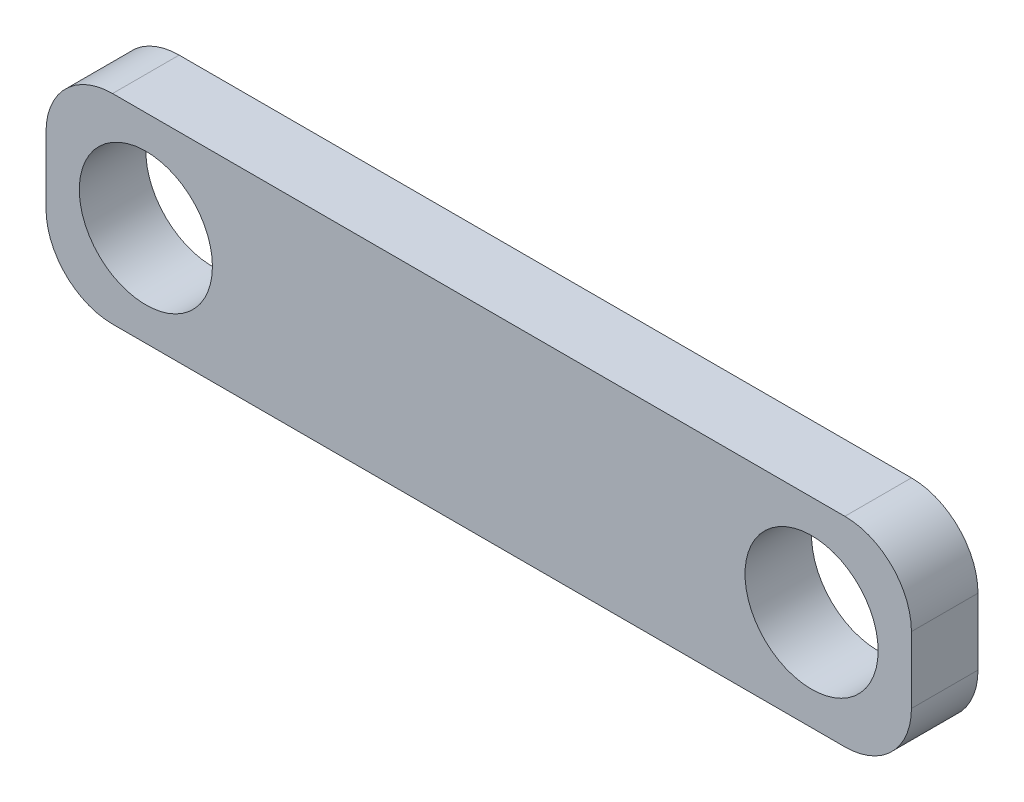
from build123d import *

# Parameters (mm, degrees)
CROQUIS1_R              = 10
SALIENTE_EXTRUIR1_DEPTH = 5


with BuildPart() as part:
    # Croquis1 → Saliente-Extruir1 (new, symmetric)
    with BuildSketch(Plane.XY):
        with BuildLine():
            Line((-55, 15), (55, 15))
            ThreePointArc((55, 15), (62.071067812, 12.071067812), (65, 5))
            Line((65, 5), (65, -5))
            ThreePointArc((65, -5), (62.071067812, -12.071067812), (55, -15))
            Line((55, -15), (-55, -15))
            ThreePointArc((-55, -15), (-62.071067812, -12.071067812), (-65, -5))
            Line((-65, -5), (-65, 5))
            ThreePointArc((-65, 5), (-62.071067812, 12.071067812), (-55, 15))
        make_face()
        with Locations((-50, 0)):
            Circle(CROQUIS1_R, mode=Mode.SUBTRACT)
        with Locations((50, 0)):
            Circle(CROQUIS1_R, mode=Mode.SUBTRACT)
    extrude(amount=SALIENTE_EXTRUIR1_DEPTH, both=True)


solid = part.part
